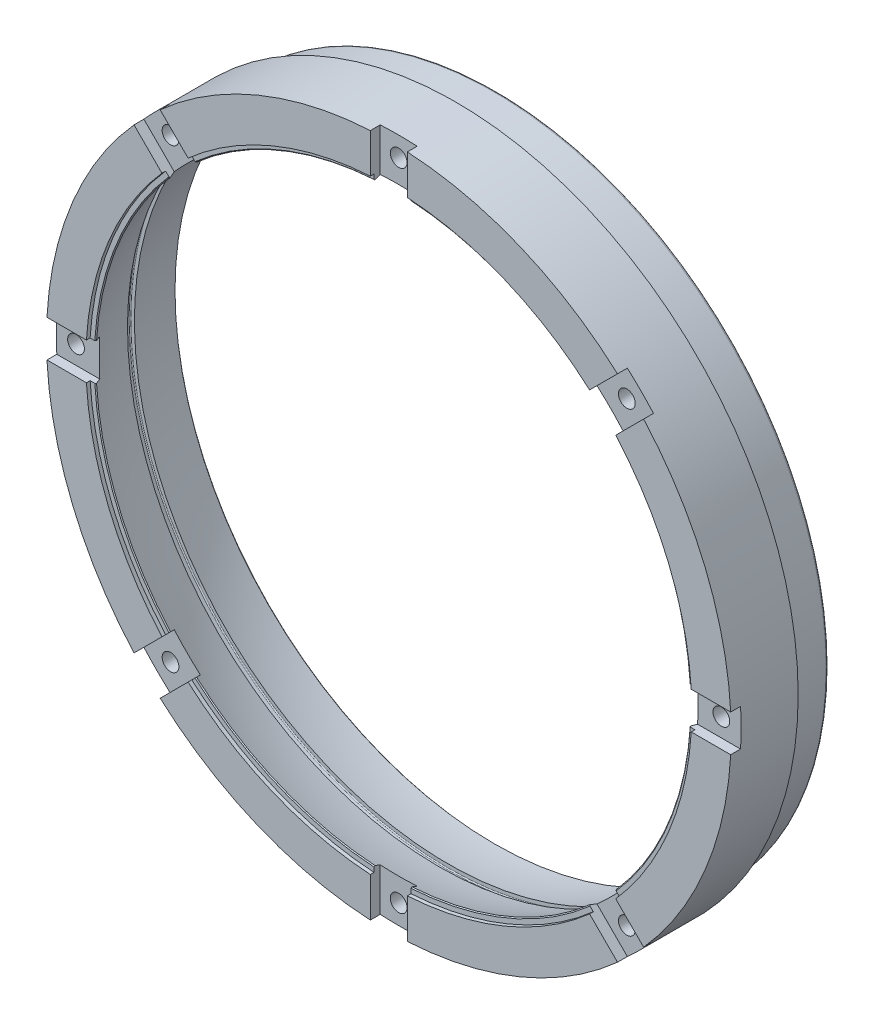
from build123d import *

# Parameters (mm, degrees)
CHANFREIN1_SIZE              = 0.5
CHANFREIN1_SIZE2             = 0.384355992
ESQUISSE2_W                  = 15
ESQUISSE2_H                  = 39.173615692
EXTRUSION1_DEPTH             = 4
R_P_TITION_CIRCULAIRE1_COUNT = 8
R_P_TITION_CIRCULAIRE2_COUNT = 8
CHANFREIN2_SIZE              = 0.5
CHANFREIN2_SIZE2             = 0.527009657
CONG_1_R                     = 1
CONG_2_R                     = 0.4


with BuildPart() as part:
    # Esquisse1 → R_volution1 (revolve)
    with BuildSketch(Plane(origin=(0, 0, 0), x_dir=(0, 0, -1), z_dir=(1, 0, 0)), mode=Mode.PRIVATE) as r_volution1_sk:
        with BuildLine():
            Line((0, 123), (0, 139))
            Line((0, 139), (27.190598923, 139))
            Line((27.190598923, 139), (29.5, 135))
            Line((29.5, 135), (43.5, 135))
            Line((43.5, 135), (43.5, 129.83739831))
            ThreePointArc((43.5, 129.83739831), (33.753992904, 128.98087941), (24.1, 127.393838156))
            Line((24.1, 127.393838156), (24.1, 129.18))
            Line((24.1, 129.18), (20.5, 129.18))
            Line((20.5, 129.18), (20.5, 126.608648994))
            ThreePointArc((20.5, 126.608648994), (10.884992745, 123.975869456), (1.5, 120.614053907))
            Line((1.5, 120.614053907), (1.5, 123))
            Line((1.5, 123), (0, 123))
        make_face()
    revolve(r_volution1_sk.sketch.rotate(Axis((0, 0, 0), (0, 0, -1)), 90), axis=Axis((0, 0, 0), (0, 0, -1)))

    # Chanfrein1
    chanfrein1_edges = [part.edges().sort_by_distance(p)[0] for p in [
        (-120.614053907, 0, -1.5),
    ]]
    chanfrein1_side = [part.faces().sort_by_distance(p)[0] for p in [
        (-120.961950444, 0, -1.5),
    ]]
    chamfer(chanfrein1_edges, length=CHANFREIN1_SIZE, length2=CHANFREIN1_SIZE2, reference=chanfrein1_side[0])

    # Esquisse2 → Extrusion1 (cut)
    with BuildSketch(Plane.XY):
        with Locations((0, 127.023357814)):
            Rectangle(ESQUISSE2_W, ESQUISSE2_H)
    extrusion1 = extrude(amount=-EXTRUSION1_DEPTH, mode=Mode.SUBTRACT)

    # R_p_tition circulaire1: Extrusion1 ×8 about axis
    r_p_tition_circulaire1_axis = Axis((0, 0, 0), (0, 0, 1))
    for i in range(1, R_P_TITION_CIRCULAIRE1_COUNT):
        add(extrusion1.rotate(r_p_tition_circulaire1_axis, i * 360 / R_P_TITION_CIRCULAIRE1_COUNT), mode=Mode.SUBTRACT)

    # Esquisse4 → Trou taraud_ M81 (revolve, cut)
    with BuildSketch(Plane(origin=(0, 131, -4), x_dir=(0, -1, 0), z_dir=(1, 0, 0))):
        Polygon((0, 0), (0, 15.042926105), (3.4, 13), (3.4, 0), align=None)
    trou_taraud_m81 = revolve(axis=Axis((0, 131, 2.35), (0, 0, -1)), mode=Mode.SUBTRACT)

    # R_p_tition circulaire2: Trou taraud_ M81 ×8 about axis
    r_p_tition_circulaire2_axis = Axis((0, 0, 0), (0, 0, 1))
    for i in range(1, R_P_TITION_CIRCULAIRE2_COUNT):
        add(trou_taraud_m81.rotate(r_p_tition_circulaire2_axis, i * 360 / R_P_TITION_CIRCULAIRE2_COUNT), mode=Mode.SUBTRACT)

    # Chanfrein2
    chanfrein2_edges = [part.edges().sort_by_distance(p)[0] for p in [
        (-129.83739831, 0, -43.5),
    ]]
    chanfrein2_side = [part.faces().sort_by_distance(p)[0] for p in [
        (-128.98087941, 0, -33.753992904),
    ]]
    chamfer(chanfrein2_edges, length=CHANFREIN2_SIZE, length2=CHANFREIN2_SIZE2, reference=chanfrein2_side[0])

    # Cong_1
    cong_1_edges = [part.edges().sort_by_distance(p)[0] for p in [
        (-135, 0, -43.5),
    ]]
    fillet(cong_1_edges, radius=CONG_1_R)

    # Cong_2
    cong_2_edges = [part.edges().sort_by_distance(p)[0] for p in [
        (-129.18, 0, -24.1),
        (-129.18, 0, -20.5),
    ]]
    fillet(cong_2_edges, radius=CONG_2_R)


solid = part.part
